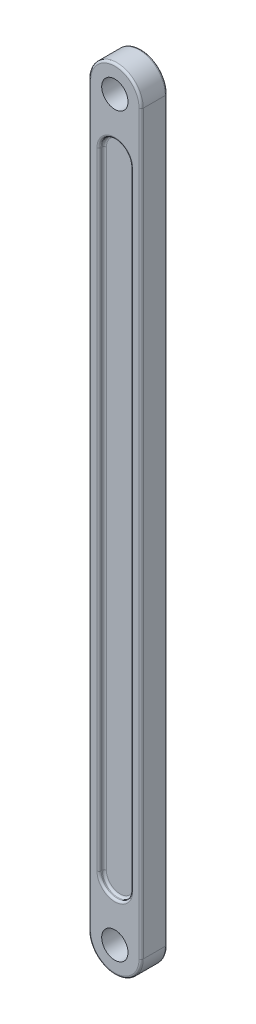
ISO-10303-21;
HEADER;
FILE_DESCRIPTION(('STEP AP214'),'2;1');
FILE_NAME('part.step','',(''),(''),'','','');
FILE_SCHEMA(('AUTOMOTIVE_DESIGN { 1 0 10303 214 1 1 1 1 }'));
ENDSEC;
DATA;
#1=APPLICATION_CONTEXT('core data for automotive mechanical design processes');
#2=APPLICATION_PROTOCOL_DEFINITION('international standard','automotive_design',2000,#1);
#3=PRODUCT_CONTEXT('',#1,'mechanical');
#4=PRODUCT('Part','Part','',(#3));
#5=PRODUCT_RELATED_PRODUCT_CATEGORY('part','',(#4));
#6=PRODUCT_DEFINITION_FORMATION('','',#4);
#7=PRODUCT_DEFINITION_CONTEXT('part definition',#1,'design');
#8=PRODUCT_DEFINITION('design','',#6,#7);
#9=PRODUCT_DEFINITION_SHAPE('','',#8);
#10=(LENGTH_UNIT() NAMED_UNIT(*) SI_UNIT(.MILLI.,.METRE.));
#11=(NAMED_UNIT(*) PLANE_ANGLE_UNIT() SI_UNIT($,.RADIAN.));
#12=(NAMED_UNIT(*) SI_UNIT($,.STERADIAN.) SOLID_ANGLE_UNIT());
#13=UNCERTAINTY_MEASURE_WITH_UNIT(LENGTH_MEASURE(1.E-05),#10,'distance_accuracy_value','');
#14=(GEOMETRIC_REPRESENTATION_CONTEXT(3) GLOBAL_UNCERTAINTY_ASSIGNED_CONTEXT((#13)) GLOBAL_UNIT_ASSIGNED_CONTEXT((#10,
#11,#12)) REPRESENTATION_CONTEXT('',''));
#15=CARTESIAN_POINT('',(0.,0.,0.));
#16=DIRECTION('',(0.,0.,1.));
#17=DIRECTION('',(1.,0.,0.));
#18=AXIS2_PLACEMENT_3D('',#15,#16,#17);
#19=CARTESIAN_POINT('',(0.,-234.799441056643,12.5));
#20=DIRECTION('',(0.,0.,1.));
#21=DIRECTION('',(1.,0.,0.));
#22=AXIS2_PLACEMENT_3D('',#19,#20,#21);
#23=PLANE('',#22);
#24=DIRECTION('',(0.,-1.,0.));
#25=VECTOR('',#24,1.);
#26=CARTESIAN_POINT('',(23.,-234.799441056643,12.5));
#27=LINE('',#26,#25);
#28=CARTESIAN_POINT('',(23.,0.,12.5));
#29=VERTEX_POINT('',#28);
#30=CARTESIAN_POINT('',(23.,700.,12.5));
#31=VERTEX_POINT('',#30);
#32=EDGE_CURVE('E318',#29,#31,#27,.F.);
#33=ORIENTED_EDGE('',*,*,#32,.T.);
#34=CARTESIAN_POINT('',(0.,700.,12.5));
#35=DIRECTION('',(0.,0.,1.));
#36=DIRECTION('',(1.,0.,0.));
#37=AXIS2_PLACEMENT_3D('',#34,#35,#36);
#38=CIRCLE('',#37,23.);
#39=CARTESIAN_POINT('',(-23.,700.,12.5));
#40=VERTEX_POINT('',#39);
#41=EDGE_CURVE('E359',#31,#40,#38,.T.);
#42=ORIENTED_EDGE('',*,*,#41,.T.);
#43=DIRECTION('',(0.,-1.,0.));
#44=VECTOR('',#43,1.);
#45=CARTESIAN_POINT('',(-23.,0.,12.5));
#46=LINE('',#45,#44);
#47=CARTESIAN_POINT('',(-23.,0.,12.5));
#48=VERTEX_POINT('',#47);
#49=EDGE_CURVE('E357',#40,#48,#46,.T.);
#50=ORIENTED_EDGE('',*,*,#49,.T.);
#51=CARTESIAN_POINT('',(0.,0.,12.5));
#52=DIRECTION('',(0.,0.,1.));
#53=DIRECTION('',(1.,0.,0.));
#54=AXIS2_PLACEMENT_3D('',#51,#52,#53);
#55=CIRCLE('',#54,23.);
#56=EDGE_CURVE('E355',#48,#29,#55,.T.);
#57=ORIENTED_EDGE('',*,*,#56,.T.);
#58=EDGE_LOOP('',(#33,#42,#50,#57));
#59=FACE_BOUND('',#58,.T.);
#60=DIRECTION('',(0.,-1.,0.));
#61=VECTOR('',#60,1.);
#62=CARTESIAN_POINT('',(-16.9999999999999,-234.799441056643,12.5));
#63=LINE('',#62,#61);
#64=CARTESIAN_POINT('',(-16.9999999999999,52.5,12.5));
#65=VERTEX_POINT('',#64);
#66=CARTESIAN_POINT('',(-17.,647.5,12.5));
#67=VERTEX_POINT('',#66);
#68=EDGE_CURVE('E287',#65,#67,#63,.F.);
#69=ORIENTED_EDGE('',*,*,#68,.T.);
#70=CARTESIAN_POINT('',(0.,647.5,12.5));
#71=DIRECTION('',(0.,0.,1.));
#72=DIRECTION('',(1.,0.,0.));
#73=AXIS2_PLACEMENT_3D('',#70,#71,#72);
#74=CIRCLE('',#73,17.);
#75=CARTESIAN_POINT('',(17.,647.5,12.5));
#76=VERTEX_POINT('',#75);
#77=EDGE_CURVE('E293',#67,#76,#74,.F.);
#78=ORIENTED_EDGE('',*,*,#77,.T.);
#79=DIRECTION('',(0.,-1.,0.));
#80=VECTOR('',#79,1.);
#81=CARTESIAN_POINT('',(17.0000000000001,52.5,12.5));
#82=LINE('',#81,#80);
#83=CARTESIAN_POINT('',(17.0000000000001,52.5,12.5));
#84=VERTEX_POINT('',#83);
#85=EDGE_CURVE('E291',#76,#84,#82,.T.);
#86=ORIENTED_EDGE('',*,*,#85,.T.);
#87=CARTESIAN_POINT('',(0.,52.5,12.5));
#88=DIRECTION('',(0.,0.,1.));
#89=DIRECTION('',(1.,0.,0.));
#90=AXIS2_PLACEMENT_3D('',#87,#88,#89);
#91=CIRCLE('',#90,17.);
#92=EDGE_CURVE('E289',#84,#65,#91,.F.);
#93=ORIENTED_EDGE('',*,*,#92,.T.);
#94=EDGE_LOOP('',(#69,#78,#86,#93));
#95=FACE_BOUND('',#94,.T.);
#96=CARTESIAN_POINT('',(0.,0.,12.5));
#97=DIRECTION('',(0.,0.,1.));
#98=DIRECTION('',(1.,0.,0.));
#99=AXIS2_PLACEMENT_3D('',#96,#97,#98);
#100=CIRCLE('',#99,12.5);
#101=CARTESIAN_POINT('',(12.5,0.,12.5));
#102=VERTEX_POINT('',#101);
#103=EDGE_CURVE('E522',#102,#102,#100,.T.);
#104=ORIENTED_EDGE('',*,*,#103,.F.);
#105=EDGE_LOOP('',(#104));
#106=FACE_BOUND('',#105,.T.);
#107=CARTESIAN_POINT('',(0.,700.,12.5));
#108=DIRECTION('',(0.,0.,1.));
#109=DIRECTION('',(1.,0.,0.));
#110=AXIS2_PLACEMENT_3D('',#107,#108,#109);
#111=CIRCLE('',#110,12.5);
#112=CARTESIAN_POINT('',(12.5,700.,12.5));
#113=VERTEX_POINT('',#112);
#114=EDGE_CURVE('E519',#113,#113,#111,.T.);
#115=ORIENTED_EDGE('',*,*,#114,.F.);
#116=EDGE_LOOP('',(#115));
#117=FACE_BOUND('',#116,.T.);
#118=ADVANCED_FACE('F58',(#59,#95,#106,#117),#23,.T.);
#119=CARTESIAN_POINT('',(0.,0.,12.5));
#120=DIRECTION('',(0.,0.,-1.));
#121=DIRECTION('',(-1.,0.,0.));
#122=AXIS2_PLACEMENT_3D('',#119,#120,#121);
#123=CYLINDRICAL_SURFACE('',#122,25.);
#124=DIRECTION('',(0.,0.,-1.));
#125=VECTOR('',#124,1.);
#126=CARTESIAN_POINT('',(25.,0.,12.5));
#127=LINE('',#126,#125);
#128=CARTESIAN_POINT('',(25.,0.,10.5));
#129=VERTEX_POINT('',#128);
#130=CARTESIAN_POINT('',(25.,0.,-10.5));
#131=VERTEX_POINT('',#130);
#132=EDGE_CURVE('E249',#129,#131,#127,.T.);
#133=ORIENTED_EDGE('',*,*,#132,.F.);
#134=CARTESIAN_POINT('',(0.,0.,10.5));
#135=DIRECTION('',(0.,0.,1.));
#136=DIRECTION('',(1.,0.,0.));
#137=AXIS2_PLACEMENT_3D('',#134,#135,#136);
#138=CIRCLE('',#137,25.);
#139=CARTESIAN_POINT('',(-25.,0.,10.5));
#140=VERTEX_POINT('',#139);
#141=EDGE_CURVE('E374',#129,#140,#138,.F.);
#142=ORIENTED_EDGE('',*,*,#141,.T.);
#143=DIRECTION('',(0.,0.,-1.));
#144=VECTOR('',#143,1.);
#145=CARTESIAN_POINT('',(-25.,0.,12.5));
#146=LINE('',#145,#144);
#147=CARTESIAN_POINT('',(-25.,0.,-10.5));
#148=VERTEX_POINT('',#147);
#149=EDGE_CURVE('E246',#140,#148,#146,.T.);
#150=ORIENTED_EDGE('',*,*,#149,.T.);
#151=CARTESIAN_POINT('',(0.,0.,-10.5));
#152=DIRECTION('',(0.,0.,1.));
#153=DIRECTION('',(1.,0.,0.));
#154=AXIS2_PLACEMENT_3D('',#151,#152,#153);
#155=CIRCLE('',#154,25.);
#156=EDGE_CURVE('E372',#148,#131,#155,.T.);
#157=ORIENTED_EDGE('',*,*,#156,.T.);
#158=EDGE_LOOP('',(#133,#142,#150,#157));
#159=FACE_BOUND('',#158,.T.);
#160=ADVANCED_FACE('F430',(#159),#123,.T.);
#161=CARTESIAN_POINT('',(25.,-234.799441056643,12.5));
#162=DIRECTION('',(1.,0.,0.));
#163=DIRECTION('',(0.,0.,-1.));
#164=AXIS2_PLACEMENT_3D('',#161,#162,#163);
#165=PLANE('',#164);
#166=DIRECTION('',(0.,0.,-1.));
#167=VECTOR('',#166,1.);
#168=CARTESIAN_POINT('',(25.,700.,12.5));
#169=LINE('',#168,#167);
#170=CARTESIAN_POINT('',(25.,700.,10.5));
#171=VERTEX_POINT('',#170);
#172=CARTESIAN_POINT('',(25.,700.,-10.5));
#173=VERTEX_POINT('',#172);
#174=EDGE_CURVE('E533',#171,#173,#169,.T.);
#175=ORIENTED_EDGE('',*,*,#174,.F.);
#176=DIRECTION('',(0.,-1.,0.));
#177=VECTOR('',#176,1.);
#178=CARTESIAN_POINT('',(25.,-234.799441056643,10.5));
#179=LINE('',#178,#177);
#180=EDGE_CURVE('E12',#171,#129,#179,.T.);
#181=ORIENTED_EDGE('',*,*,#180,.T.);
#182=ORIENTED_EDGE('',*,*,#132,.T.);
#183=DIRECTION('',(0.,-1.,0.));
#184=VECTOR('',#183,1.);
#185=CARTESIAN_POINT('',(25.,700.,-10.5));
#186=LINE('',#185,#184);
#187=EDGE_CURVE('E67',#131,#173,#186,.F.);
#188=ORIENTED_EDGE('',*,*,#187,.T.);
#189=EDGE_LOOP('',(#175,#181,#182,#188));
#190=FACE_BOUND('',#189,.T.);
#191=ADVANCED_FACE('F435',(#190),#165,.T.);
#192=CARTESIAN_POINT('',(0.,700.,12.5));
#193=DIRECTION('',(0.,0.,-1.));
#194=DIRECTION('',(-1.,0.,0.));
#195=AXIS2_PLACEMENT_3D('',#192,#193,#194);
#196=CYLINDRICAL_SURFACE('',#195,25.);
#197=DIRECTION('',(0.,0.,-1.));
#198=VECTOR('',#197,1.);
#199=CARTESIAN_POINT('',(-25.,700.,12.5));
#200=LINE('',#199,#198);
#201=CARTESIAN_POINT('',(-25.,700.,10.5));
#202=VERTEX_POINT('',#201);
#203=CARTESIAN_POINT('',(-25.,700.,-10.5));
#204=VERTEX_POINT('',#203);
#205=EDGE_CURVE('E526',#202,#204,#200,.T.);
#206=ORIENTED_EDGE('',*,*,#205,.F.);
#207=CARTESIAN_POINT('',(0.,700.,10.5));
#208=DIRECTION('',(0.,0.,1.));
#209=DIRECTION('',(1.,0.,0.));
#210=AXIS2_PLACEMENT_3D('',#207,#208,#209);
#211=CIRCLE('',#210,25.);
#212=EDGE_CURVE('E365',#202,#171,#211,.F.);
#213=ORIENTED_EDGE('',*,*,#212,.T.);
#214=ORIENTED_EDGE('',*,*,#174,.T.);
#215=CARTESIAN_POINT('',(0.,700.,-10.5));
#216=DIRECTION('',(0.,0.,1.));
#217=DIRECTION('',(1.,0.,0.));
#218=AXIS2_PLACEMENT_3D('',#215,#216,#217);
#219=CIRCLE('',#218,25.);
#220=EDGE_CURVE('E362',#173,#204,#219,.T.);
#221=ORIENTED_EDGE('',*,*,#220,.T.);
#222=EDGE_LOOP('',(#206,#213,#214,#221));
#223=FACE_BOUND('',#222,.T.);
#224=ADVANCED_FACE('F562',(#223),#196,.T.);
#225=CARTESIAN_POINT('',(-25.,-234.799441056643,12.5));
#226=DIRECTION('',(1.,0.,0.));
#227=DIRECTION('',(0.,0.,-1.));
#228=AXIS2_PLACEMENT_3D('',#225,#226,#227);
#229=PLANE('',#228);
#230=ORIENTED_EDGE('',*,*,#149,.F.);
#231=DIRECTION('',(0.,-1.,0.));
#232=VECTOR('',#231,1.);
#233=CARTESIAN_POINT('',(-25.,700.,10.5));
#234=LINE('',#233,#232);
#235=EDGE_CURVE('E370',#140,#202,#234,.F.);
#236=ORIENTED_EDGE('',*,*,#235,.T.);
#237=ORIENTED_EDGE('',*,*,#205,.T.);
#238=DIRECTION('',(0.,-1.,0.));
#239=VECTOR('',#238,1.);
#240=CARTESIAN_POINT('',(-25.,-234.799441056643,-10.5));
#241=LINE('',#240,#239);
#242=EDGE_CURVE('E368',#204,#148,#241,.T.);
#243=ORIENTED_EDGE('',*,*,#242,.T.);
#244=EDGE_LOOP('',(#230,#236,#237,#243));
#245=FACE_BOUND('',#244,.T.);
#246=ADVANCED_FACE('F559',(#245),#229,.F.);
#247=CARTESIAN_POINT('',(0.,0.,12.5));
#248=DIRECTION('',(0.,0.,-1.));
#249=DIRECTION('',(-1.,0.,0.));
#250=AXIS2_PLACEMENT_3D('',#247,#248,#249);
#251=CYLINDRICAL_SURFACE('',#250,12.5);
#252=ORIENTED_EDGE('',*,*,#103,.T.);
#253=EDGE_LOOP('',(#252));
#254=FACE_BOUND('',#253,.T.);
#255=CARTESIAN_POINT('',(0.,0.,-12.5));
#256=DIRECTION('',(0.,0.,1.));
#257=DIRECTION('',(1.,0.,0.));
#258=AXIS2_PLACEMENT_3D('',#255,#256,#257);
#259=CIRCLE('',#258,12.5);
#260=CARTESIAN_POINT('',(12.5,0.,-12.5));
#261=VERTEX_POINT('',#260);
#262=EDGE_CURVE('E523',#261,#261,#259,.T.);
#263=ORIENTED_EDGE('',*,*,#262,.F.);
#264=EDGE_LOOP('',(#263));
#265=FACE_BOUND('',#264,.T.);
#266=ADVANCED_FACE('F424',(#254,#265),#251,.F.);
#267=CARTESIAN_POINT('',(0.,700.,12.5));
#268=DIRECTION('',(0.,0.,-1.));
#269=DIRECTION('',(-1.,0.,0.));
#270=AXIS2_PLACEMENT_3D('',#267,#268,#269);
#271=CYLINDRICAL_SURFACE('',#270,12.5);
#272=ORIENTED_EDGE('',*,*,#114,.T.);
#273=EDGE_LOOP('',(#272));
#274=FACE_BOUND('',#273,.T.);
#275=CARTESIAN_POINT('',(0.,700.,-12.5));
#276=DIRECTION('',(0.,0.,1.));
#277=DIRECTION('',(1.,0.,0.));
#278=AXIS2_PLACEMENT_3D('',#275,#276,#277);
#279=CIRCLE('',#278,12.5);
#280=CARTESIAN_POINT('',(12.5,700.,-12.5));
#281=VERTEX_POINT('',#280);
#282=EDGE_CURVE('E518',#281,#281,#279,.T.);
#283=ORIENTED_EDGE('',*,*,#282,.F.);
#284=EDGE_LOOP('',(#283));
#285=FACE_BOUND('',#284,.T.);
#286=ADVANCED_FACE('F415',(#274,#285),#271,.F.);
#287=CARTESIAN_POINT('',(0.,-234.799441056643,-12.5));
#288=DIRECTION('',(0.,0.,1.));
#289=DIRECTION('',(1.,0.,0.));
#290=AXIS2_PLACEMENT_3D('',#287,#288,#289);
#291=PLANE('',#290);
#292=DIRECTION('',(0.,-1.,0.));
#293=VECTOR('',#292,1.);
#294=CARTESIAN_POINT('',(-23.,-234.799441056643,-12.5));
#295=LINE('',#294,#293);
#296=CARTESIAN_POINT('',(-23.,0.,-12.5));
#297=VERTEX_POINT('',#296);
#298=CARTESIAN_POINT('',(-23.,700.,-12.5));
#299=VERTEX_POINT('',#298);
#300=EDGE_CURVE('E75',#297,#299,#295,.F.);
#301=ORIENTED_EDGE('',*,*,#300,.T.);
#302=CARTESIAN_POINT('',(0.,700.,-12.5));
#303=DIRECTION('',(0.,0.,1.));
#304=DIRECTION('',(1.,0.,0.));
#305=AXIS2_PLACEMENT_3D('',#302,#303,#304);
#306=CIRCLE('',#305,23.);
#307=CARTESIAN_POINT('',(23.,700.,-12.5));
#308=VERTEX_POINT('',#307);
#309=EDGE_CURVE('E380',#299,#308,#306,.F.);
#310=ORIENTED_EDGE('',*,*,#309,.T.);
#311=DIRECTION('',(0.,-1.,0.));
#312=VECTOR('',#311,1.);
#313=CARTESIAN_POINT('',(23.,0.,-12.5));
#314=LINE('',#313,#312);
#315=CARTESIAN_POINT('',(23.,0.,-12.5));
#316=VERTEX_POINT('',#315);
#317=EDGE_CURVE('E376',#308,#316,#314,.T.);
#318=ORIENTED_EDGE('',*,*,#317,.T.);
#319=CARTESIAN_POINT('',(0.,0.,-12.5));
#320=DIRECTION('',(0.,0.,1.));
#321=DIRECTION('',(1.,0.,0.));
#322=AXIS2_PLACEMENT_3D('',#319,#320,#321);
#323=CIRCLE('',#322,23.);
#324=EDGE_CURVE('E80',#316,#297,#323,.F.);
#325=ORIENTED_EDGE('',*,*,#324,.T.);
#326=EDGE_LOOP('',(#301,#310,#318,#325));
#327=FACE_BOUND('',#326,.T.);
#328=DIRECTION('',(0.,-1.,0.));
#329=VECTOR('',#328,1.);
#330=CARTESIAN_POINT('',(-16.9999999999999,-234.799441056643,-12.5));
#331=LINE('',#330,#329);
#332=CARTESIAN_POINT('',(-17.,647.5,-12.5));
#333=VERTEX_POINT('',#332);
#334=CARTESIAN_POINT('',(-16.9999999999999,52.5,-12.5));
#335=VERTEX_POINT('',#334);
#336=EDGE_CURVE('E225',#333,#335,#331,.T.);
#337=ORIENTED_EDGE('',*,*,#336,.T.);
#338=CARTESIAN_POINT('',(0.,52.5,-12.5));
#339=DIRECTION('',(0.,0.,1.));
#340=DIRECTION('',(1.,0.,0.));
#341=AXIS2_PLACEMENT_3D('',#338,#339,#340);
#342=CIRCLE('',#341,17.);
#343=CARTESIAN_POINT('',(17.0000000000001,52.5,-12.5));
#344=VERTEX_POINT('',#343);
#345=EDGE_CURVE('E254',#335,#344,#342,.T.);
#346=ORIENTED_EDGE('',*,*,#345,.T.);
#347=DIRECTION('',(0.,-1.,0.));
#348=VECTOR('',#347,1.);
#349=CARTESIAN_POINT('',(17.,647.5,-12.5));
#350=LINE('',#349,#348);
#351=CARTESIAN_POINT('',(17.,647.5,-12.5));
#352=VERTEX_POINT('',#351);
#353=EDGE_CURVE('E228',#344,#352,#350,.F.);
#354=ORIENTED_EDGE('',*,*,#353,.T.);
#355=CARTESIAN_POINT('',(0.,647.5,-12.5));
#356=DIRECTION('',(0.,0.,1.));
#357=DIRECTION('',(1.,0.,0.));
#358=AXIS2_PLACEMENT_3D('',#355,#356,#357);
#359=CIRCLE('',#358,17.);
#360=EDGE_CURVE('E219',#352,#333,#359,.T.);
#361=ORIENTED_EDGE('',*,*,#360,.T.);
#362=EDGE_LOOP('',(#337,#346,#354,#361));
#363=FACE_BOUND('',#362,.T.);
#364=ORIENTED_EDGE('',*,*,#282,.T.);
#365=EDGE_LOOP('',(#364));
#366=FACE_BOUND('',#365,.T.);
#367=ORIENTED_EDGE('',*,*,#262,.T.);
#368=EDGE_LOOP('',(#367));
#369=FACE_BOUND('',#368,.T.);
#370=ADVANCED_FACE('F221',(#327,#363,#366,#369),#291,.F.);
#371=CARTESIAN_POINT('',(0.,647.5,12.5));
#372=DIRECTION('',(0.,0.,-1.));
#373=DIRECTION('',(-1.,0.,0.));
#374=AXIS2_PLACEMENT_3D('',#371,#372,#373);
#375=CYLINDRICAL_SURFACE('',#374,15.);
#376=DIRECTION('',(0.,0.,-1.));
#377=VECTOR('',#376,1.);
#378=CARTESIAN_POINT('',(15.,647.5,12.5));
#379=LINE('',#378,#377);
#380=CARTESIAN_POINT('',(15.,647.5,10.5));
#381=VERTEX_POINT('',#380);
#382=CARTESIAN_POINT('',(15.,647.5,9.5));
#383=VERTEX_POINT('',#382);
#384=EDGE_CURVE('E506',#381,#383,#379,.T.);
#385=ORIENTED_EDGE('',*,*,#384,.F.);
#386=CARTESIAN_POINT('',(0.,647.5,10.5));
#387=DIRECTION('',(0.,0.,1.));
#388=DIRECTION('',(1.,0.,0.));
#389=AXIS2_PLACEMENT_3D('',#386,#387,#388);
#390=CIRCLE('',#389,15.);
#391=CARTESIAN_POINT('',(-15.,647.5,10.5));
#392=VERTEX_POINT('',#391);
#393=EDGE_CURVE('E284',#381,#392,#390,.T.);
#394=ORIENTED_EDGE('',*,*,#393,.T.);
#395=DIRECTION('',(0.,0.,-1.));
#396=VECTOR('',#395,1.);
#397=CARTESIAN_POINT('',(-15.,647.5,12.5));
#398=LINE('',#397,#396);
#399=CARTESIAN_POINT('',(-15.,647.5,9.5));
#400=VERTEX_POINT('',#399);
#401=EDGE_CURVE('E515',#392,#400,#398,.T.);
#402=ORIENTED_EDGE('',*,*,#401,.T.);
#403=CARTESIAN_POINT('',(0.,647.5,9.5));
#404=DIRECTION('',(0.,0.,1.));
#405=DIRECTION('',(1.,0.,0.));
#406=AXIS2_PLACEMENT_3D('',#403,#404,#405);
#407=CIRCLE('',#406,15.);
#408=EDGE_CURVE('E282',#400,#383,#407,.F.);
#409=ORIENTED_EDGE('',*,*,#408,.T.);
#410=EDGE_LOOP('',(#385,#394,#402,#409));
#411=FACE_BOUND('',#410,.T.);
#412=ADVANCED_FACE('F414',(#411),#375,.F.);
#413=CARTESIAN_POINT('',(-15.,647.5,12.5));
#414=DIRECTION('',(1.,0.,0.));
#415=DIRECTION('',(0.,1.,0.));
#416=AXIS2_PLACEMENT_3D('',#413,#414,#415);
#417=PLANE('',#416);
#418=ORIENTED_EDGE('',*,*,#401,.F.);
#419=DIRECTION('',(0.,-1.,0.));
#420=VECTOR('',#419,1.);
#421=CARTESIAN_POINT('',(-15.,647.5,10.5));
#422=LINE('',#421,#420);
#423=CARTESIAN_POINT('',(-14.9999999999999,52.5,10.5));
#424=VERTEX_POINT('',#423);
#425=EDGE_CURVE('E307',#392,#424,#422,.T.);
#426=ORIENTED_EDGE('',*,*,#425,.T.);
#427=DIRECTION('',(0.,0.,-1.));
#428=VECTOR('',#427,1.);
#429=CARTESIAN_POINT('',(-14.9999999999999,52.5,12.5));
#430=LINE('',#429,#428);
#431=CARTESIAN_POINT('',(-14.9999999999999,52.5,9.5));
#432=VERTEX_POINT('',#431);
#433=EDGE_CURVE('E512',#424,#432,#430,.T.);
#434=ORIENTED_EDGE('',*,*,#433,.T.);
#435=DIRECTION('',(0.,-1.,0.));
#436=VECTOR('',#435,1.);
#437=CARTESIAN_POINT('',(-15.,647.5,9.5));
#438=LINE('',#437,#436);
#439=EDGE_CURVE('E305',#432,#400,#438,.F.);
#440=ORIENTED_EDGE('',*,*,#439,.T.);
#441=EDGE_LOOP('',(#418,#426,#434,#440));
#442=FACE_BOUND('',#441,.T.);
#443=ADVANCED_FACE('F421',(#442),#417,.T.);
#444=CARTESIAN_POINT('',(0.,52.5,12.5));
#445=DIRECTION('',(0.,0.,-1.));
#446=DIRECTION('',(-1.,0.,0.));
#447=AXIS2_PLACEMENT_3D('',#444,#445,#446);
#448=CYLINDRICAL_SURFACE('',#447,15.);
#449=ORIENTED_EDGE('',*,*,#433,.F.);
#450=CARTESIAN_POINT('',(0.,52.5,10.5));
#451=DIRECTION('',(0.,0.,1.));
#452=DIRECTION('',(1.,0.,0.));
#453=AXIS2_PLACEMENT_3D('',#450,#451,#452);
#454=CIRCLE('',#453,15.);
#455=CARTESIAN_POINT('',(15.0000000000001,52.5,10.5));
#456=VERTEX_POINT('',#455);
#457=EDGE_CURVE('E303',#424,#456,#454,.T.);
#458=ORIENTED_EDGE('',*,*,#457,.T.);
#459=DIRECTION('',(0.,0.,-1.));
#460=VECTOR('',#459,1.);
#461=CARTESIAN_POINT('',(15.0000000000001,52.5,12.5));
#462=LINE('',#461,#460);
#463=CARTESIAN_POINT('',(15.0000000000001,52.5,9.5));
#464=VERTEX_POINT('',#463);
#465=EDGE_CURVE('E509',#456,#464,#462,.T.);
#466=ORIENTED_EDGE('',*,*,#465,.T.);
#467=CARTESIAN_POINT('',(0.,52.5,9.5));
#468=DIRECTION('',(0.,0.,1.));
#469=DIRECTION('',(1.,0.,0.));
#470=AXIS2_PLACEMENT_3D('',#467,#468,#469);
#471=CIRCLE('',#470,15.);
#472=EDGE_CURVE('E300',#464,#432,#471,.F.);
#473=ORIENTED_EDGE('',*,*,#472,.T.);
#474=EDGE_LOOP('',(#449,#458,#466,#473));
#475=FACE_BOUND('',#474,.T.);
#476=ADVANCED_FACE('F442',(#475),#448,.F.);
#477=CARTESIAN_POINT('',(15.,647.5,12.5));
#478=DIRECTION('',(1.,0.,0.));
#479=DIRECTION('',(0.,1.,0.));
#480=AXIS2_PLACEMENT_3D('',#477,#478,#479);
#481=PLANE('',#480);
#482=ORIENTED_EDGE('',*,*,#465,.F.);
#483=DIRECTION('',(0.,-1.,0.));
#484=VECTOR('',#483,1.);
#485=CARTESIAN_POINT('',(15.,647.5,10.5));
#486=LINE('',#485,#484);
#487=EDGE_CURVE('E298',#456,#381,#486,.F.);
#488=ORIENTED_EDGE('',*,*,#487,.T.);
#489=ORIENTED_EDGE('',*,*,#384,.T.);
#490=DIRECTION('',(0.,-1.,0.));
#491=VECTOR('',#490,1.);
#492=CARTESIAN_POINT('',(15.,647.5,9.5));
#493=LINE('',#492,#491);
#494=EDGE_CURVE('E296',#383,#464,#493,.T.);
#495=ORIENTED_EDGE('',*,*,#494,.T.);
#496=EDGE_LOOP('',(#482,#488,#489,#495));
#497=FACE_BOUND('',#496,.T.);
#498=ADVANCED_FACE('F446',(#497),#481,.F.);
#499=CARTESIAN_POINT('',(0.,647.5,7.5));
#500=DIRECTION('',(0.,0.,1.));
#501=DIRECTION('',(1.,0.,0.));
#502=AXIS2_PLACEMENT_3D('',#499,#500,#501);
#503=PLANE('',#502);
#504=DIRECTION('',(0.,-1.,0.));
#505=VECTOR('',#504,1.);
#506=CARTESIAN_POINT('',(-12.9999999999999,52.5,7.5));
#507=LINE('',#506,#505);
#508=CARTESIAN_POINT('',(-13.,647.5,7.5));
#509=VERTEX_POINT('',#508);
#510=CARTESIAN_POINT('',(-12.9999999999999,52.5,7.5));
#511=VERTEX_POINT('',#510);
#512=EDGE_CURVE('E309',#509,#511,#507,.T.);
#513=ORIENTED_EDGE('',*,*,#512,.T.);
#514=CARTESIAN_POINT('',(0.,52.5,7.5));
#515=DIRECTION('',(0.,0.,1.));
#516=DIRECTION('',(1.,0.,0.));
#517=AXIS2_PLACEMENT_3D('',#514,#515,#516);
#518=CIRCLE('',#517,13.);
#519=CARTESIAN_POINT('',(13.0000000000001,52.5,7.5));
#520=VERTEX_POINT('',#519);
#521=EDGE_CURVE('E315',#511,#520,#518,.T.);
#522=ORIENTED_EDGE('',*,*,#521,.T.);
#523=DIRECTION('',(0.,-1.,0.));
#524=VECTOR('',#523,1.);
#525=CARTESIAN_POINT('',(13.,647.5,7.5));
#526=LINE('',#525,#524);
#527=CARTESIAN_POINT('',(13.,647.5,7.5));
#528=VERTEX_POINT('',#527);
#529=EDGE_CURVE('E313',#520,#528,#526,.F.);
#530=ORIENTED_EDGE('',*,*,#529,.T.);
#531=CARTESIAN_POINT('',(0.,647.5,7.5));
#532=DIRECTION('',(0.,0.,1.));
#533=DIRECTION('',(1.,0.,0.));
#534=AXIS2_PLACEMENT_3D('',#531,#532,#533);
#535=CIRCLE('',#534,13.);
#536=EDGE_CURVE('E311',#528,#509,#535,.T.);
#537=ORIENTED_EDGE('',*,*,#536,.T.);
#538=EDGE_LOOP('',(#513,#522,#530,#537));
#539=FACE_BOUND('',#538,.T.);
#540=ADVANCED_FACE('F450',(#539),#503,.T.);
#541=CARTESIAN_POINT('',(0.,647.5,-12.5));
#542=DIRECTION('',(0.,0.,1.));
#543=DIRECTION('',(1.,0.,0.));
#544=AXIS2_PLACEMENT_3D('',#541,#542,#543);
#545=CYLINDRICAL_SURFACE('',#544,15.);
#546=DIRECTION('',(0.,0.,1.));
#547=VECTOR('',#546,1.);
#548=CARTESIAN_POINT('',(-15.,647.5,-12.5));
#549=LINE('',#548,#547);
#550=CARTESIAN_POINT('',(-15.,647.5,-10.5));
#551=VERTEX_POINT('',#550);
#552=CARTESIAN_POINT('',(-15.,647.5,-9.5));
#553=VERTEX_POINT('',#552);
#554=EDGE_CURVE('E240',#551,#553,#549,.T.);
#555=ORIENTED_EDGE('',*,*,#554,.F.);
#556=CARTESIAN_POINT('',(0.,647.5,-10.5));
#557=DIRECTION('',(0.,0.,1.));
#558=DIRECTION('',(1.,0.,0.));
#559=AXIS2_PLACEMENT_3D('',#556,#557,#558);
#560=CIRCLE('',#559,15.);
#561=CARTESIAN_POINT('',(15.,647.5,-10.5));
#562=VERTEX_POINT('',#561);
#563=EDGE_CURVE('E237',#551,#562,#560,.F.);
#564=ORIENTED_EDGE('',*,*,#563,.T.);
#565=DIRECTION('',(0.,0.,1.));
#566=VECTOR('',#565,1.);
#567=CARTESIAN_POINT('',(15.,647.5,-12.5));
#568=LINE('',#567,#566);
#569=CARTESIAN_POINT('',(15.,647.5,-9.5));
#570=VERTEX_POINT('',#569);
#571=EDGE_CURVE('E497',#562,#570,#568,.T.);
#572=ORIENTED_EDGE('',*,*,#571,.T.);
#573=CARTESIAN_POINT('',(0.,647.5,-9.5));
#574=DIRECTION('',(0.,0.,-1.));
#575=DIRECTION('',(-1.,0.,0.));
#576=AXIS2_PLACEMENT_3D('',#573,#574,#575);
#577=CIRCLE('',#576,15.);
#578=EDGE_CURVE('E265',#570,#553,#577,.F.);
#579=ORIENTED_EDGE('',*,*,#578,.T.);
#580=EDGE_LOOP('',(#555,#564,#572,#579));
#581=FACE_BOUND('',#580,.T.);
#582=ADVANCED_FACE('F454',(#581),#545,.F.);
#583=CARTESIAN_POINT('',(15.,647.5,-12.5));
#584=DIRECTION('',(-1.,0.,0.));
#585=DIRECTION('',(0.,-1.,0.));
#586=AXIS2_PLACEMENT_3D('',#583,#584,#585);
#587=PLANE('',#586);
#588=ORIENTED_EDGE('',*,*,#571,.F.);
#589=DIRECTION('',(0.,-1.,0.));
#590=VECTOR('',#589,1.);
#591=CARTESIAN_POINT('',(15.0000000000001,52.5,-10.5));
#592=LINE('',#591,#590);
#593=CARTESIAN_POINT('',(15.0000000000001,52.5,-10.5));
#594=VERTEX_POINT('',#593);
#595=EDGE_CURVE('E263',#562,#594,#592,.T.);
#596=ORIENTED_EDGE('',*,*,#595,.T.);
#597=DIRECTION('',(0.,0.,1.));
#598=VECTOR('',#597,1.);
#599=CARTESIAN_POINT('',(15.0000000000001,52.5,-12.5));
#600=LINE('',#599,#598);
#601=CARTESIAN_POINT('',(15.0000000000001,52.5,-9.5));
#602=VERTEX_POINT('',#601);
#603=EDGE_CURVE('E500',#594,#602,#600,.T.);
#604=ORIENTED_EDGE('',*,*,#603,.T.);
#605=DIRECTION('',(0.,-1.,0.));
#606=VECTOR('',#605,1.);
#607=CARTESIAN_POINT('',(15.,647.5,-9.5));
#608=LINE('',#607,#606);
#609=EDGE_CURVE('E261',#602,#570,#608,.F.);
#610=ORIENTED_EDGE('',*,*,#609,.T.);
#611=EDGE_LOOP('',(#588,#596,#604,#610));
#612=FACE_BOUND('',#611,.T.);
#613=ADVANCED_FACE('F458',(#612),#587,.T.);
#614=CARTESIAN_POINT('',(0.,52.5,-12.5));
#615=DIRECTION('',(0.,0.,1.));
#616=DIRECTION('',(1.,0.,0.));
#617=AXIS2_PLACEMENT_3D('',#614,#615,#616);
#618=CYLINDRICAL_SURFACE('',#617,15.);
#619=ORIENTED_EDGE('',*,*,#603,.F.);
#620=CARTESIAN_POINT('',(0.,52.5,-10.5));
#621=DIRECTION('',(0.,0.,1.));
#622=DIRECTION('',(1.,0.,0.));
#623=AXIS2_PLACEMENT_3D('',#620,#621,#622);
#624=CIRCLE('',#623,15.);
#625=CARTESIAN_POINT('',(-14.9999999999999,52.5,-10.5));
#626=VERTEX_POINT('',#625);
#627=EDGE_CURVE('E258',#594,#626,#624,.F.);
#628=ORIENTED_EDGE('',*,*,#627,.T.);
#629=DIRECTION('',(0.,0.,1.));
#630=VECTOR('',#629,1.);
#631=CARTESIAN_POINT('',(-14.9999999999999,52.5,-12.5));
#632=LINE('',#631,#630);
#633=CARTESIAN_POINT('',(-14.9999999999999,52.5,-9.5));
#634=VERTEX_POINT('',#633);
#635=EDGE_CURVE('E498',#626,#634,#632,.T.);
#636=ORIENTED_EDGE('',*,*,#635,.T.);
#637=CARTESIAN_POINT('',(0.,52.5,-9.5));
#638=DIRECTION('',(0.,0.,-1.));
#639=DIRECTION('',(-1.,0.,0.));
#640=AXIS2_PLACEMENT_3D('',#637,#638,#639);
#641=CIRCLE('',#640,15.);
#642=EDGE_CURVE('E256',#634,#602,#641,.F.);
#643=ORIENTED_EDGE('',*,*,#642,.T.);
#644=EDGE_LOOP('',(#619,#628,#636,#643));
#645=FACE_BOUND('',#644,.T.);
#646=ADVANCED_FACE('F462',(#645),#618,.F.);
#647=CARTESIAN_POINT('',(-15.,647.5,-12.5));
#648=DIRECTION('',(-1.,0.,0.));
#649=DIRECTION('',(0.,-1.,0.));
#650=AXIS2_PLACEMENT_3D('',#647,#648,#649);
#651=PLANE('',#650);
#652=ORIENTED_EDGE('',*,*,#635,.F.);
#653=DIRECTION('',(0.,-1.,0.));
#654=VECTOR('',#653,1.);
#655=CARTESIAN_POINT('',(-15.,647.5,-10.5));
#656=LINE('',#655,#654);
#657=EDGE_CURVE('E271',#626,#551,#656,.F.);
#658=ORIENTED_EDGE('',*,*,#657,.T.);
#659=ORIENTED_EDGE('',*,*,#554,.T.);
#660=DIRECTION('',(0.,-1.,0.));
#661=VECTOR('',#660,1.);
#662=CARTESIAN_POINT('',(-15.,647.5,-9.5));
#663=LINE('',#662,#661);
#664=EDGE_CURVE('E269',#553,#634,#663,.T.);
#665=ORIENTED_EDGE('',*,*,#664,.T.);
#666=EDGE_LOOP('',(#652,#658,#659,#665));
#667=FACE_BOUND('',#666,.T.);
#668=ADVANCED_FACE('F466',(#667),#651,.F.);
#669=CARTESIAN_POINT('',(0.,647.5,-7.5));
#670=DIRECTION('',(0.,0.,-1.));
#671=DIRECTION('',(1.,0.,0.));
#672=AXIS2_PLACEMENT_3D('',#669,#670,#671);
#673=PLANE('',#672);
#674=DIRECTION('',(0.,-1.,0.));
#675=VECTOR('',#674,1.);
#676=CARTESIAN_POINT('',(-13.,647.5,-7.5));
#677=LINE('',#676,#675);
#678=CARTESIAN_POINT('',(-12.9999999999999,52.5,-7.5));
#679=VERTEX_POINT('',#678);
#680=CARTESIAN_POINT('',(-13.,647.5,-7.5));
#681=VERTEX_POINT('',#680);
#682=EDGE_CURVE('E273',#679,#681,#677,.F.);
#683=ORIENTED_EDGE('',*,*,#682,.T.);
#684=CARTESIAN_POINT('',(0.,647.5,-7.5));
#685=DIRECTION('',(0.,0.,-1.));
#686=DIRECTION('',(-1.,0.,0.));
#687=AXIS2_PLACEMENT_3D('',#684,#685,#686);
#688=CIRCLE('',#687,13.);
#689=CARTESIAN_POINT('',(13.,647.5,-7.5));
#690=VERTEX_POINT('',#689);
#691=EDGE_CURVE('E279',#681,#690,#688,.T.);
#692=ORIENTED_EDGE('',*,*,#691,.T.);
#693=DIRECTION('',(0.,-1.,0.));
#694=VECTOR('',#693,1.);
#695=CARTESIAN_POINT('',(13.0000000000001,52.5,-7.5));
#696=LINE('',#695,#694);
#697=CARTESIAN_POINT('',(13.0000000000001,52.5,-7.5));
#698=VERTEX_POINT('',#697);
#699=EDGE_CURVE('E277',#690,#698,#696,.T.);
#700=ORIENTED_EDGE('',*,*,#699,.T.);
#701=CARTESIAN_POINT('',(0.,52.5,-7.5));
#702=DIRECTION('',(0.,0.,-1.));
#703=DIRECTION('',(-1.,0.,0.));
#704=AXIS2_PLACEMENT_3D('',#701,#702,#703);
#705=CIRCLE('',#704,13.);
#706=EDGE_CURVE('E275',#698,#679,#705,.T.);
#707=ORIENTED_EDGE('',*,*,#706,.T.);
#708=EDGE_LOOP('',(#683,#692,#700,#707));
#709=FACE_BOUND('',#708,.T.);
#710=ADVANCED_FACE('F470',(#709),#673,.T.);
#711=CARTESIAN_POINT('',(0.,647.5,-10.5));
#712=DIRECTION('',(0.,0.,1.));
#713=DIRECTION('',(1.,0.,0.));
#714=AXIS2_PLACEMENT_3D('',#711,#712,#713);
#715=TOROIDAL_SURFACE('',#714,17.,2.);
#716=CARTESIAN_POINT('',(17.,647.5,-10.5));
#717=DIRECTION('',(0.,-1.,0.));
#718=DIRECTION('',(0.,0.,-1.));
#719=AXIS2_PLACEMENT_3D('',#716,#717,#718);
#720=CIRCLE('',#719,2.);
#721=EDGE_CURVE('E241',#562,#352,#720,.T.);
#722=ORIENTED_EDGE('',*,*,#721,.F.);
#723=ORIENTED_EDGE('',*,*,#563,.F.);
#724=CARTESIAN_POINT('',(-17.,647.5,-10.5));
#725=DIRECTION('',(0.,-1.,0.));
#726=DIRECTION('',(0.,0.,-1.));
#727=AXIS2_PLACEMENT_3D('',#724,#725,#726);
#728=CIRCLE('',#727,2.);
#729=EDGE_CURVE('E235',#333,#551,#728,.T.);
#730=ORIENTED_EDGE('',*,*,#729,.F.);
#731=ORIENTED_EDGE('',*,*,#360,.F.);
#732=EDGE_LOOP('',(#722,#723,#730,#731));
#733=FACE_BOUND('',#732,.T.);
#734=ADVANCED_FACE('F236',(#733),#715,.T.);
#735=CARTESIAN_POINT('',(-16.9999999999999,-234.799441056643,-10.5));
#736=DIRECTION('',(0.,-1.,0.));
#737=DIRECTION('',(1.,0.,0.));
#738=AXIS2_PLACEMENT_3D('',#735,#736,#737);
#739=CYLINDRICAL_SURFACE('',#738,2.);
#740=ORIENTED_EDGE('',*,*,#729,.T.);
#741=ORIENTED_EDGE('',*,*,#657,.F.);
#742=CARTESIAN_POINT('',(-16.9999999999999,52.5,-10.5));
#743=DIRECTION('',(0.,-1.,0.));
#744=DIRECTION('',(0.,0.,-1.));
#745=AXIS2_PLACEMENT_3D('',#742,#743,#744);
#746=CIRCLE('',#745,2.);
#747=EDGE_CURVE('E244',#335,#626,#746,.T.);
#748=ORIENTED_EDGE('',*,*,#747,.F.);
#749=ORIENTED_EDGE('',*,*,#336,.F.);
#750=EDGE_LOOP('',(#740,#741,#748,#749));
#751=FACE_BOUND('',#750,.T.);
#752=ADVANCED_FACE('F243',(#751),#739,.T.);
#753=CARTESIAN_POINT('',(17.,647.5,-10.5));
#754=DIRECTION('',(0.,1.,0.));
#755=DIRECTION('',(-1.,0.,0.));
#756=AXIS2_PLACEMENT_3D('',#753,#754,#755);
#757=CYLINDRICAL_SURFACE('',#756,2.);
#758=ORIENTED_EDGE('',*,*,#721,.T.);
#759=ORIENTED_EDGE('',*,*,#353,.F.);
#760=CARTESIAN_POINT('',(17.0000000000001,52.5,-10.5));
#761=DIRECTION('',(0.,-1.,0.));
#762=DIRECTION('',(0.,0.,-1.));
#763=AXIS2_PLACEMENT_3D('',#760,#761,#762);
#764=CIRCLE('',#763,2.);
#765=EDGE_CURVE('E319',#594,#344,#764,.T.);
#766=ORIENTED_EDGE('',*,*,#765,.F.);
#767=ORIENTED_EDGE('',*,*,#595,.F.);
#768=EDGE_LOOP('',(#758,#759,#766,#767));
#769=FACE_BOUND('',#768,.T.);
#770=ADVANCED_FACE('F735',(#769),#757,.T.);
#771=CARTESIAN_POINT('',(0.,52.5,-10.5));
#772=DIRECTION('',(0.,0.,1.));
#773=DIRECTION('',(1.,0.,0.));
#774=AXIS2_PLACEMENT_3D('',#771,#772,#773);
#775=TOROIDAL_SURFACE('',#774,17.,2.);
#776=ORIENTED_EDGE('',*,*,#747,.T.);
#777=ORIENTED_EDGE('',*,*,#627,.F.);
#778=ORIENTED_EDGE('',*,*,#765,.T.);
#779=ORIENTED_EDGE('',*,*,#345,.F.);
#780=EDGE_LOOP('',(#776,#777,#778,#779));
#781=FACE_BOUND('',#780,.T.);
#782=ADVANCED_FACE('F726',(#781),#775,.T.);
#783=CARTESIAN_POINT('',(0.,52.5,-9.5));
#784=DIRECTION('',(0.,0.,-1.));
#785=DIRECTION('',(-1.,0.,0.));
#786=AXIS2_PLACEMENT_3D('',#783,#784,#785);
#787=TOROIDAL_SURFACE('',#786,13.,2.);
#788=CARTESIAN_POINT('',(-12.9999999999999,52.5,-9.5));
#789=DIRECTION('',(0.,-1.,0.));
#790=DIRECTION('',(0.,0.,-1.));
#791=AXIS2_PLACEMENT_3D('',#788,#789,#790);
#792=CIRCLE('',#791,2.);
#793=EDGE_CURVE('E329',#679,#634,#792,.T.);
#794=ORIENTED_EDGE('',*,*,#793,.F.);
#795=ORIENTED_EDGE('',*,*,#706,.F.);
#796=CARTESIAN_POINT('',(13.0000000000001,52.5,-9.5));
#797=DIRECTION('',(0.,-1.,0.));
#798=DIRECTION('',(0.,0.,-1.));
#799=AXIS2_PLACEMENT_3D('',#796,#797,#798);
#800=CIRCLE('',#799,2.);
#801=EDGE_CURVE('E321',#602,#698,#800,.T.);
#802=ORIENTED_EDGE('',*,*,#801,.F.);
#803=ORIENTED_EDGE('',*,*,#642,.F.);
#804=EDGE_LOOP('',(#794,#795,#802,#803));
#805=FACE_BOUND('',#804,.T.);
#806=ADVANCED_FACE('F717',(#805),#787,.F.);
#807=CARTESIAN_POINT('',(13.,647.5,-9.5));
#808=DIRECTION('',(0.,1.,0.));
#809=DIRECTION('',(-1.,0.,0.));
#810=AXIS2_PLACEMENT_3D('',#807,#808,#809);
#811=CYLINDRICAL_SURFACE('',#810,2.);
#812=ORIENTED_EDGE('',*,*,#801,.T.);
#813=ORIENTED_EDGE('',*,*,#699,.F.);
#814=CARTESIAN_POINT('',(13.,647.5,-9.5));
#815=DIRECTION('',(0.,-1.,0.));
#816=DIRECTION('',(0.,0.,-1.));
#817=AXIS2_PLACEMENT_3D('',#814,#815,#816);
#818=CIRCLE('',#817,2.);
#819=EDGE_CURVE('E326',#570,#690,#818,.T.);
#820=ORIENTED_EDGE('',*,*,#819,.F.);
#821=ORIENTED_EDGE('',*,*,#609,.F.);
#822=EDGE_LOOP('',(#812,#813,#820,#821));
#823=FACE_BOUND('',#822,.T.);
#824=ADVANCED_FACE('F709',(#823),#811,.F.);
#825=CARTESIAN_POINT('',(-13.,647.5,-9.5));
#826=DIRECTION('',(0.,-1.,0.));
#827=DIRECTION('',(1.,0.,0.));
#828=AXIS2_PLACEMENT_3D('',#825,#826,#827);
#829=CYLINDRICAL_SURFACE('',#828,2.);
#830=ORIENTED_EDGE('',*,*,#793,.T.);
#831=ORIENTED_EDGE('',*,*,#664,.F.);
#832=CARTESIAN_POINT('',(-13.,647.5,-9.5));
#833=DIRECTION('',(0.,-1.,0.));
#834=DIRECTION('',(0.,0.,-1.));
#835=AXIS2_PLACEMENT_3D('',#832,#833,#834);
#836=CIRCLE('',#835,2.);
#837=EDGE_CURVE('E324',#681,#553,#836,.T.);
#838=ORIENTED_EDGE('',*,*,#837,.F.);
#839=ORIENTED_EDGE('',*,*,#682,.F.);
#840=EDGE_LOOP('',(#830,#831,#838,#839));
#841=FACE_BOUND('',#840,.T.);
#842=ADVANCED_FACE('F490',(#841),#829,.F.);
#843=CARTESIAN_POINT('',(0.,647.5,-9.5));
#844=DIRECTION('',(0.,0.,-1.));
#845=DIRECTION('',(-1.,0.,0.));
#846=AXIS2_PLACEMENT_3D('',#843,#844,#845);
#847=TOROIDAL_SURFACE('',#846,13.,2.);
#848=ORIENTED_EDGE('',*,*,#819,.T.);
#849=ORIENTED_EDGE('',*,*,#691,.F.);
#850=ORIENTED_EDGE('',*,*,#837,.T.);
#851=ORIENTED_EDGE('',*,*,#578,.F.);
#852=EDGE_LOOP('',(#848,#849,#850,#851));
#853=FACE_BOUND('',#852,.T.);
#854=ADVANCED_FACE('F485',(#853),#847,.F.);
#855=CARTESIAN_POINT('',(0.,52.5,10.5));
#856=DIRECTION('',(0.,0.,1.));
#857=DIRECTION('',(1.,0.,0.));
#858=AXIS2_PLACEMENT_3D('',#855,#856,#857);
#859=TOROIDAL_SURFACE('',#858,17.,2.);
#860=CARTESIAN_POINT('',(-16.9999999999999,52.5,10.5));
#861=DIRECTION('',(0.,1.,0.));
#862=DIRECTION('',(0.,0.,1.));
#863=AXIS2_PLACEMENT_3D('',#860,#861,#862);
#864=CIRCLE('',#863,2.);
#865=EDGE_CURVE('E339',#65,#424,#864,.T.);
#866=ORIENTED_EDGE('',*,*,#865,.F.);
#867=ORIENTED_EDGE('',*,*,#92,.F.);
#868=CARTESIAN_POINT('',(17.0000000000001,52.5,10.5));
#869=DIRECTION('',(0.,1.,0.));
#870=DIRECTION('',(0.,0.,1.));
#871=AXIS2_PLACEMENT_3D('',#868,#869,#870);
#872=CIRCLE('',#871,2.);
#873=EDGE_CURVE('E327',#456,#84,#872,.T.);
#874=ORIENTED_EDGE('',*,*,#873,.F.);
#875=ORIENTED_EDGE('',*,*,#457,.F.);
#876=EDGE_LOOP('',(#866,#867,#874,#875));
#877=FACE_BOUND('',#876,.T.);
#878=ADVANCED_FACE('F685',(#877),#859,.T.);
#879=CARTESIAN_POINT('',(17.0000000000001,-234.799441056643,10.5));
#880=DIRECTION('',(0.,1.,0.));
#881=DIRECTION('',(-1.,0.,0.));
#882=AXIS2_PLACEMENT_3D('',#879,#880,#881);
#883=CYLINDRICAL_SURFACE('',#882,2.);
#884=ORIENTED_EDGE('',*,*,#873,.T.);
#885=ORIENTED_EDGE('',*,*,#85,.F.);
#886=CARTESIAN_POINT('',(17.,647.5,10.5));
#887=DIRECTION('',(0.,1.,0.));
#888=DIRECTION('',(0.,0.,1.));
#889=AXIS2_PLACEMENT_3D('',#886,#887,#888);
#890=CIRCLE('',#889,2.);
#891=EDGE_CURVE('E336',#381,#76,#890,.T.);
#892=ORIENTED_EDGE('',*,*,#891,.F.);
#893=ORIENTED_EDGE('',*,*,#487,.F.);
#894=EDGE_LOOP('',(#884,#885,#892,#893));
#895=FACE_BOUND('',#894,.T.);
#896=ADVANCED_FACE('F676',(#895),#883,.T.);
#897=CARTESIAN_POINT('',(-17.,647.5,10.5));
#898=DIRECTION('',(0.,-1.,0.));
#899=DIRECTION('',(1.,0.,0.));
#900=AXIS2_PLACEMENT_3D('',#897,#898,#899);
#901=CYLINDRICAL_SURFACE('',#900,2.);
#902=ORIENTED_EDGE('',*,*,#865,.T.);
#903=ORIENTED_EDGE('',*,*,#425,.F.);
#904=CARTESIAN_POINT('',(-17.,647.5,10.5));
#905=DIRECTION('',(0.,1.,0.));
#906=DIRECTION('',(0.,0.,1.));
#907=AXIS2_PLACEMENT_3D('',#904,#905,#906);
#908=CIRCLE('',#907,2.);
#909=EDGE_CURVE('E334',#67,#392,#908,.T.);
#910=ORIENTED_EDGE('',*,*,#909,.F.);
#911=ORIENTED_EDGE('',*,*,#68,.F.);
#912=EDGE_LOOP('',(#902,#903,#910,#911));
#913=FACE_BOUND('',#912,.T.);
#914=ADVANCED_FACE('F667',(#913),#901,.T.);
#915=CARTESIAN_POINT('',(0.,647.5,10.5));
#916=DIRECTION('',(0.,0.,1.));
#917=DIRECTION('',(1.,0.,0.));
#918=AXIS2_PLACEMENT_3D('',#915,#916,#917);
#919=TOROIDAL_SURFACE('',#918,17.,2.);
#920=ORIENTED_EDGE('',*,*,#891,.T.);
#921=ORIENTED_EDGE('',*,*,#77,.F.);
#922=ORIENTED_EDGE('',*,*,#909,.T.);
#923=ORIENTED_EDGE('',*,*,#393,.F.);
#924=EDGE_LOOP('',(#920,#921,#922,#923));
#925=FACE_BOUND('',#924,.T.);
#926=ADVANCED_FACE('F659',(#925),#919,.T.);
#927=CARTESIAN_POINT('',(0.,647.5,9.5));
#928=DIRECTION('',(0.,0.,1.));
#929=DIRECTION('',(1.,0.,0.));
#930=AXIS2_PLACEMENT_3D('',#927,#928,#929);
#931=TOROIDAL_SURFACE('',#930,13.,2.);
#932=CARTESIAN_POINT('',(13.,647.5,9.5));
#933=DIRECTION('',(0.,1.,0.));
#934=DIRECTION('',(0.,0.,1.));
#935=AXIS2_PLACEMENT_3D('',#932,#933,#934);
#936=CIRCLE('',#935,2.);
#937=EDGE_CURVE('E349',#383,#528,#936,.T.);
#938=ORIENTED_EDGE('',*,*,#937,.F.);
#939=ORIENTED_EDGE('',*,*,#408,.F.);
#940=CARTESIAN_POINT('',(-13.,647.5,9.5));
#941=DIRECTION('',(0.,1.,0.));
#942=DIRECTION('',(0.,0.,1.));
#943=AXIS2_PLACEMENT_3D('',#940,#941,#942);
#944=CIRCLE('',#943,2.);
#945=EDGE_CURVE('E337',#509,#400,#944,.T.);
#946=ORIENTED_EDGE('',*,*,#945,.F.);
#947=ORIENTED_EDGE('',*,*,#536,.F.);
#948=EDGE_LOOP('',(#938,#939,#946,#947));
#949=FACE_BOUND('',#948,.T.);
#950=ADVANCED_FACE('F573',(#949),#931,.F.);
#951=CARTESIAN_POINT('',(-13.,647.5,9.5));
#952=DIRECTION('',(0.,1.,0.));
#953=DIRECTION('',(-1.,0.,0.));
#954=AXIS2_PLACEMENT_3D('',#951,#952,#953);
#955=CYLINDRICAL_SURFACE('',#954,2.);
#956=ORIENTED_EDGE('',*,*,#945,.T.);
#957=ORIENTED_EDGE('',*,*,#439,.F.);
#958=CARTESIAN_POINT('',(-12.9999999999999,52.5,9.5));
#959=DIRECTION('',(0.,1.,0.));
#960=DIRECTION('',(0.,0.,1.));
#961=AXIS2_PLACEMENT_3D('',#958,#959,#960);
#962=CIRCLE('',#961,2.);
#963=EDGE_CURVE('E346',#511,#432,#962,.T.);
#964=ORIENTED_EDGE('',*,*,#963,.F.);
#965=ORIENTED_EDGE('',*,*,#512,.F.);
#966=EDGE_LOOP('',(#956,#957,#964,#965));
#967=FACE_BOUND('',#966,.T.);
#968=ADVANCED_FACE('F643',(#967),#955,.F.);
#969=CARTESIAN_POINT('',(13.,647.5,9.5));
#970=DIRECTION('',(0.,-1.,0.));
#971=DIRECTION('',(1.,0.,0.));
#972=AXIS2_PLACEMENT_3D('',#969,#970,#971);
#973=CYLINDRICAL_SURFACE('',#972,2.);
#974=ORIENTED_EDGE('',*,*,#937,.T.);
#975=ORIENTED_EDGE('',*,*,#529,.F.);
#976=CARTESIAN_POINT('',(13.0000000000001,52.5,9.5));
#977=DIRECTION('',(0.,1.,0.));
#978=DIRECTION('',(0.,0.,1.));
#979=AXIS2_PLACEMENT_3D('',#976,#977,#978);
#980=CIRCLE('',#979,2.);
#981=EDGE_CURVE('E344',#464,#520,#980,.T.);
#982=ORIENTED_EDGE('',*,*,#981,.F.);
#983=ORIENTED_EDGE('',*,*,#494,.F.);
#984=EDGE_LOOP('',(#974,#975,#982,#983));
#985=FACE_BOUND('',#984,.T.);
#986=ADVANCED_FACE('F634',(#985),#973,.F.);
#987=CARTESIAN_POINT('',(0.,52.5,9.5));
#988=DIRECTION('',(0.,0.,1.));
#989=DIRECTION('',(1.,0.,0.));
#990=AXIS2_PLACEMENT_3D('',#987,#988,#989);
#991=TOROIDAL_SURFACE('',#990,13.,2.);
#992=ORIENTED_EDGE('',*,*,#963,.T.);
#993=ORIENTED_EDGE('',*,*,#472,.F.);
#994=ORIENTED_EDGE('',*,*,#981,.T.);
#995=ORIENTED_EDGE('',*,*,#521,.F.);
#996=EDGE_LOOP('',(#992,#993,#994,#995));
#997=FACE_BOUND('',#996,.T.);
#998=ADVANCED_FACE('F580',(#997),#991,.F.);
#999=CARTESIAN_POINT('',(0.,0.,10.5));
#1000=DIRECTION('',(0.,0.,1.));
#1001=DIRECTION('',(1.,0.,0.));
#1002=AXIS2_PLACEMENT_3D('',#999,#1000,#1001);
#1003=TOROIDAL_SURFACE('',#1002,23.,2.);
#1004=CARTESIAN_POINT('',(-23.,0.,10.5));
#1005=DIRECTION('',(0.,1.,0.));
#1006=DIRECTION('',(0.,0.,1.));
#1007=AXIS2_PLACEMENT_3D('',#1004,#1005,#1006);
#1008=CIRCLE('',#1007,2.);
#1009=EDGE_CURVE('E387',#140,#48,#1008,.T.);
#1010=ORIENTED_EDGE('',*,*,#1009,.F.);
#1011=ORIENTED_EDGE('',*,*,#141,.F.);
#1012=CARTESIAN_POINT('',(23.,0.,10.5));
#1013=DIRECTION('',(0.,1.,0.));
#1014=DIRECTION('',(0.,0.,1.));
#1015=AXIS2_PLACEMENT_3D('',#1012,#1013,#1014);
#1016=CIRCLE('',#1015,2.);
#1017=EDGE_CURVE('E347',#29,#129,#1016,.T.);
#1018=ORIENTED_EDGE('',*,*,#1017,.F.);
#1019=ORIENTED_EDGE('',*,*,#56,.F.);
#1020=EDGE_LOOP('',(#1010,#1011,#1018,#1019));
#1021=FACE_BOUND('',#1020,.T.);
#1022=ADVANCED_FACE('F545',(#1021),#1003,.T.);
#1023=CARTESIAN_POINT('',(23.,-234.799441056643,10.5));
#1024=DIRECTION('',(0.,-1.,0.));
#1025=DIRECTION('',(0.,0.,-1.));
#1026=AXIS2_PLACEMENT_3D('',#1023,#1024,#1025);
#1027=CYLINDRICAL_SURFACE('',#1026,2.);
#1028=ORIENTED_EDGE('',*,*,#1017,.T.);
#1029=ORIENTED_EDGE('',*,*,#180,.F.);
#1030=CARTESIAN_POINT('',(23.,700.,10.5));
#1031=DIRECTION('',(0.,1.,0.));
#1032=DIRECTION('',(0.,0.,1.));
#1033=AXIS2_PLACEMENT_3D('',#1030,#1031,#1032);
#1034=CIRCLE('',#1033,2.);
#1035=EDGE_CURVE('E385',#31,#171,#1034,.T.);
#1036=ORIENTED_EDGE('',*,*,#1035,.F.);
#1037=ORIENTED_EDGE('',*,*,#32,.F.);
#1038=EDGE_LOOP('',(#1028,#1029,#1036,#1037));
#1039=FACE_BOUND('',#1038,.T.);
#1040=ADVANCED_FACE('F550',(#1039),#1027,.T.);
#1041=CARTESIAN_POINT('',(-23.,-234.799441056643,10.5));
#1042=DIRECTION('',(0.,1.,0.));
#1043=DIRECTION('',(0.,0.,1.));
#1044=AXIS2_PLACEMENT_3D('',#1041,#1042,#1043);
#1045=CYLINDRICAL_SURFACE('',#1044,2.);
#1046=ORIENTED_EDGE('',*,*,#1009,.T.);
#1047=ORIENTED_EDGE('',*,*,#49,.F.);
#1048=CARTESIAN_POINT('',(-23.,700.,10.5));
#1049=DIRECTION('',(0.,1.,0.));
#1050=DIRECTION('',(0.,0.,1.));
#1051=AXIS2_PLACEMENT_3D('',#1048,#1049,#1050);
#1052=CIRCLE('',#1051,2.);
#1053=EDGE_CURVE('E383',#202,#40,#1052,.T.);
#1054=ORIENTED_EDGE('',*,*,#1053,.F.);
#1055=ORIENTED_EDGE('',*,*,#235,.F.);
#1056=EDGE_LOOP('',(#1046,#1047,#1054,#1055));
#1057=FACE_BOUND('',#1056,.T.);
#1058=ADVANCED_FACE('F555',(#1057),#1045,.T.);
#1059=CARTESIAN_POINT('',(0.,700.,10.5));
#1060=DIRECTION('',(0.,0.,1.));
#1061=DIRECTION('',(1.,0.,0.));
#1062=AXIS2_PLACEMENT_3D('',#1059,#1060,#1061);
#1063=TOROIDAL_SURFACE('',#1062,23.,2.);
#1064=ORIENTED_EDGE('',*,*,#1035,.T.);
#1065=ORIENTED_EDGE('',*,*,#212,.F.);
#1066=ORIENTED_EDGE('',*,*,#1053,.T.);
#1067=ORIENTED_EDGE('',*,*,#41,.F.);
#1068=EDGE_LOOP('',(#1064,#1065,#1066,#1067));
#1069=FACE_BOUND('',#1068,.T.);
#1070=ADVANCED_FACE('F564',(#1069),#1063,.T.);
#1071=CARTESIAN_POINT('',(0.,0.,-10.5));
#1072=DIRECTION('',(0.,0.,1.));
#1073=DIRECTION('',(1.,0.,0.));
#1074=AXIS2_PLACEMENT_3D('',#1071,#1072,#1073);
#1075=TOROIDAL_SURFACE('',#1074,23.,2.);
#1076=CARTESIAN_POINT('',(-23.,0.,-10.5));
#1077=DIRECTION('',(0.,1.,0.));
#1078=DIRECTION('',(0.,0.,1.));
#1079=AXIS2_PLACEMENT_3D('',#1076,#1077,#1078);
#1080=CIRCLE('',#1079,2.);
#1081=EDGE_CURVE('E395',#297,#148,#1080,.T.);
#1082=ORIENTED_EDGE('',*,*,#1081,.F.);
#1083=ORIENTED_EDGE('',*,*,#324,.F.);
#1084=CARTESIAN_POINT('',(23.,0.,-10.5));
#1085=DIRECTION('',(0.,1.,0.));
#1086=DIRECTION('',(0.,0.,1.));
#1087=AXIS2_PLACEMENT_3D('',#1084,#1085,#1086);
#1088=CIRCLE('',#1087,2.);
#1089=EDGE_CURVE('E62',#131,#316,#1088,.T.);
#1090=ORIENTED_EDGE('',*,*,#1089,.F.);
#1091=ORIENTED_EDGE('',*,*,#156,.F.);
#1092=EDGE_LOOP('',(#1082,#1083,#1090,#1091));
#1093=FACE_BOUND('',#1092,.T.);
#1094=ADVANCED_FACE('F60',(#1093),#1075,.T.);
#1095=CARTESIAN_POINT('',(23.,-234.799441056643,-10.5));
#1096=DIRECTION('',(0.,1.,0.));
#1097=DIRECTION('',(0.,0.,1.));
#1098=AXIS2_PLACEMENT_3D('',#1095,#1096,#1097);
#1099=CYLINDRICAL_SURFACE('',#1098,2.);
#1100=ORIENTED_EDGE('',*,*,#1089,.T.);
#1101=ORIENTED_EDGE('',*,*,#317,.F.);
#1102=CARTESIAN_POINT('',(23.,700.,-10.5));
#1103=DIRECTION('',(0.,1.,0.));
#1104=DIRECTION('',(0.,0.,1.));
#1105=AXIS2_PLACEMENT_3D('',#1102,#1103,#1104);
#1106=CIRCLE('',#1105,2.);
#1107=EDGE_CURVE('E394',#173,#308,#1106,.T.);
#1108=ORIENTED_EDGE('',*,*,#1107,.F.);
#1109=ORIENTED_EDGE('',*,*,#187,.F.);
#1110=EDGE_LOOP('',(#1100,#1101,#1108,#1109));
#1111=FACE_BOUND('',#1110,.T.);
#1112=ADVANCED_FACE('F404',(#1111),#1099,.T.);
#1113=CARTESIAN_POINT('',(-23.,-234.799441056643,-10.5));
#1114=DIRECTION('',(0.,-1.,0.));
#1115=DIRECTION('',(0.,0.,-1.));
#1116=AXIS2_PLACEMENT_3D('',#1113,#1114,#1115);
#1117=CYLINDRICAL_SURFACE('',#1116,2.);
#1118=ORIENTED_EDGE('',*,*,#1081,.T.);
#1119=ORIENTED_EDGE('',*,*,#242,.F.);
#1120=CARTESIAN_POINT('',(-23.,700.,-10.5));
#1121=DIRECTION('',(0.,1.,0.));
#1122=DIRECTION('',(0.,0.,1.));
#1123=AXIS2_PLACEMENT_3D('',#1120,#1121,#1122);
#1124=CIRCLE('',#1123,2.);
#1125=EDGE_CURVE('E392',#299,#204,#1124,.T.);
#1126=ORIENTED_EDGE('',*,*,#1125,.F.);
#1127=ORIENTED_EDGE('',*,*,#300,.F.);
#1128=EDGE_LOOP('',(#1118,#1119,#1126,#1127));
#1129=FACE_BOUND('',#1128,.T.);
#1130=ADVANCED_FACE('F409',(#1129),#1117,.T.);
#1131=CARTESIAN_POINT('',(0.,700.,-10.5));
#1132=DIRECTION('',(0.,0.,1.));
#1133=DIRECTION('',(1.,0.,0.));
#1134=AXIS2_PLACEMENT_3D('',#1131,#1132,#1133);
#1135=TOROIDAL_SURFACE('',#1134,23.,2.);
#1136=ORIENTED_EDGE('',*,*,#1107,.T.);
#1137=ORIENTED_EDGE('',*,*,#309,.F.);
#1138=ORIENTED_EDGE('',*,*,#1125,.T.);
#1139=ORIENTED_EDGE('',*,*,#220,.F.);
#1140=EDGE_LOOP('',(#1136,#1137,#1138,#1139));
#1141=FACE_BOUND('',#1140,.T.);
#1142=ADVANCED_FACE('F412',(#1141),#1135,.T.);
#1143=CLOSED_SHELL('',(#118,#160,#191,#224,#246,#266,#286,#370,#412,#443,#476,#498,#540,#582,
#613,#646,#668,#710,#734,#752,#770,#782,#806,#824,#842,#854,#878,#896,#914,#926,#950,#968,#986,
#998,#1022,#1040,#1058,#1070,#1094,#1112,#1130,#1142));
#1144=MANIFOLD_SOLID_BREP('B2',#1143);
#1145=ADVANCED_BREP_SHAPE_REPRESENTATION('',(#18,#1144),#14);
#1146=SHAPE_DEFINITION_REPRESENTATION(#9,#1145);
ENDSEC;
END-ISO-10303-21;
